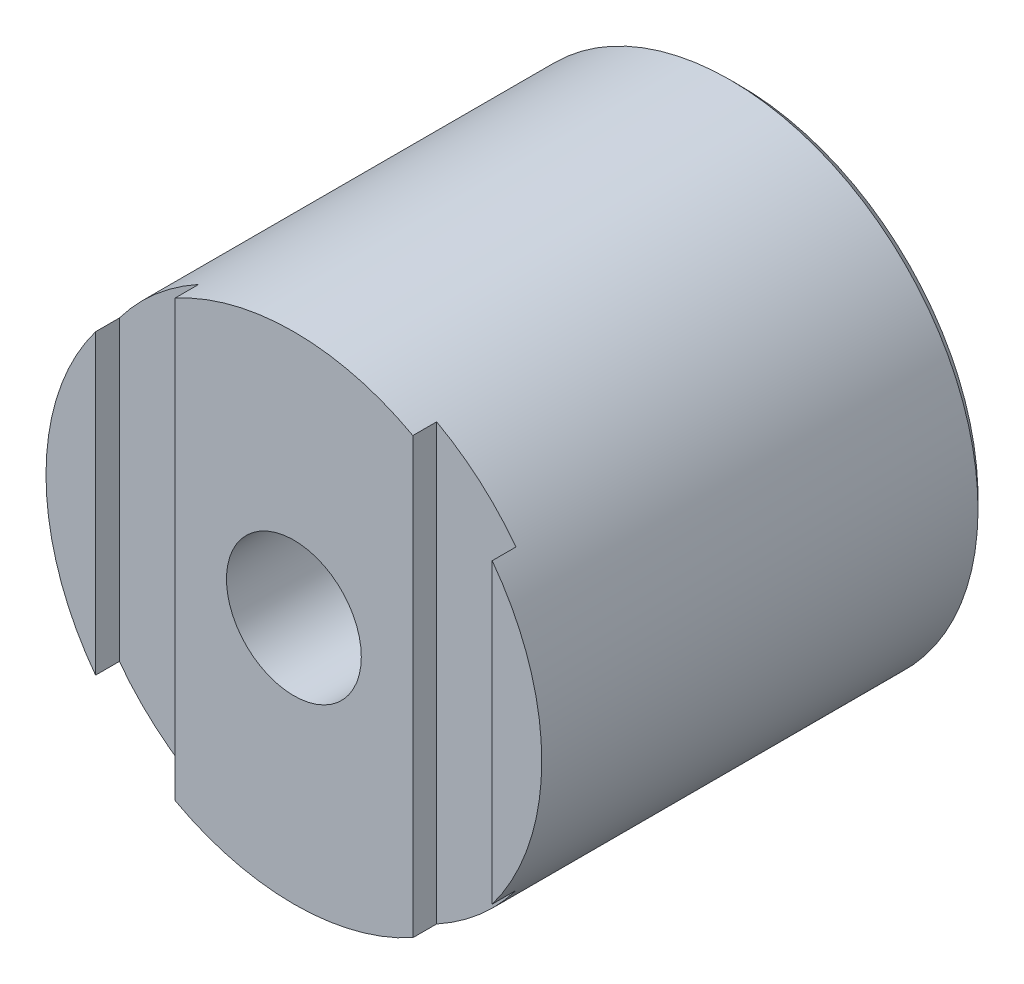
from build123d import *

# Parameters (mm, degrees)
ESQUISSE2_W             = 12.5
ESQUISSE2_H             = 22.5
ENL_V_START             = -1.2
ENL_V_MAT_EXTRU_1_DEPTH = 1.2
TROU_TARAUD_M8X1_251_D  = 6.8
CHANFREIN1_SIZE         = 0.5


with BuildPart() as part:
    # Esquisse2 → R_volution1 (revolve)
    with BuildSketch(Plane(origin=(0, 0, 0), x_dir=(1, 0, 0), z_dir=(0, 1, 0))):
        with Locations((6.25, 11.25)):
            Rectangle(ESQUISSE2_W, ESQUISSE2_H)
    revolve(axis=Axis((0, 0, 0), (0, 0, -1)))

    # Esquisse3 → Enl_vement de mati_re-R_volution1 (revolve, cut)
    with BuildSketch(Plane(origin=(0, 0, 0), x_dir=(1, 0, 0), z_dir=(0, 1, 0))):
        with BuildLine():
            Line((0, 9.5), (0, 22.5))
            Line((0, 22.5), (7.25, 22.5))
            Line((7.25, 22.5), (7.25, 21.799038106))
            Line((7.25, 21.799038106), (6.5, 20.5))
            Line((6.5, 20.5), (6.5, 19.3))
            Line((6.5, 19.3), (8.05, 19.3))
            Line((8.05, 19.3), (8.05, 17.75))
            Line((8.05, 17.75), (6.5, 17.75))
            Line((6.5, 17.75), (6.5, 16))
            ThreePointArc((6.5, 16), (4.596194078, 11.403805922), (0, 9.5))
        make_face()
    revolve(axis=Axis((0, 0, 0), (0, 0, -1)), mode=Mode.SUBTRACT)

    # Esquisse6 → Enl_v. mat.-Extru.1 (cut)
    with BuildSketch(Plane.XY.offset(ENL_V_START)):
        with BuildLine():
            Line((6, 10.9658561), (6, -10.9658561))
            ThreePointArc((6, -10.9658561), (8.185538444, -9.447060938), (10, -7.5))
            Line((10, -7.5), (10, 7.5))
            ThreePointArc((10, 7.5), (8.185538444, 9.447060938), (6, 10.9658561))
        make_face()
        with BuildLine():
            Line((-10, 7.5), (-10, -7.5))
            ThreePointArc((-10, -7.5), (-8.185538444, -9.447060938), (-6, -10.9658561))
            Line((-6, -10.9658561), (-6, 10.9658561))
            ThreePointArc((-6, 10.9658561), (-8.185538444, 9.447060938), (-10, 7.5))
        make_face()
    extrude(amount=ENL_V_MAT_EXTRU_1_DEPTH, mode=Mode.SUBTRACT)

    # Trou taraud_ M8x1.251 (through all)
    with Locations(Plane.XY):
        with Locations((0, 0)):
            Hole(TROU_TARAUD_M8X1_251_D / 2)

    # Chanfrein1
    chanfrein1_edges = [part.edges().sort_by_distance(p)[0] for p in [
        (-12.5, 0, -22.5),
    ]]
    chamfer(chanfrein1_edges, length=CHANFREIN1_SIZE)


solid = part.part
